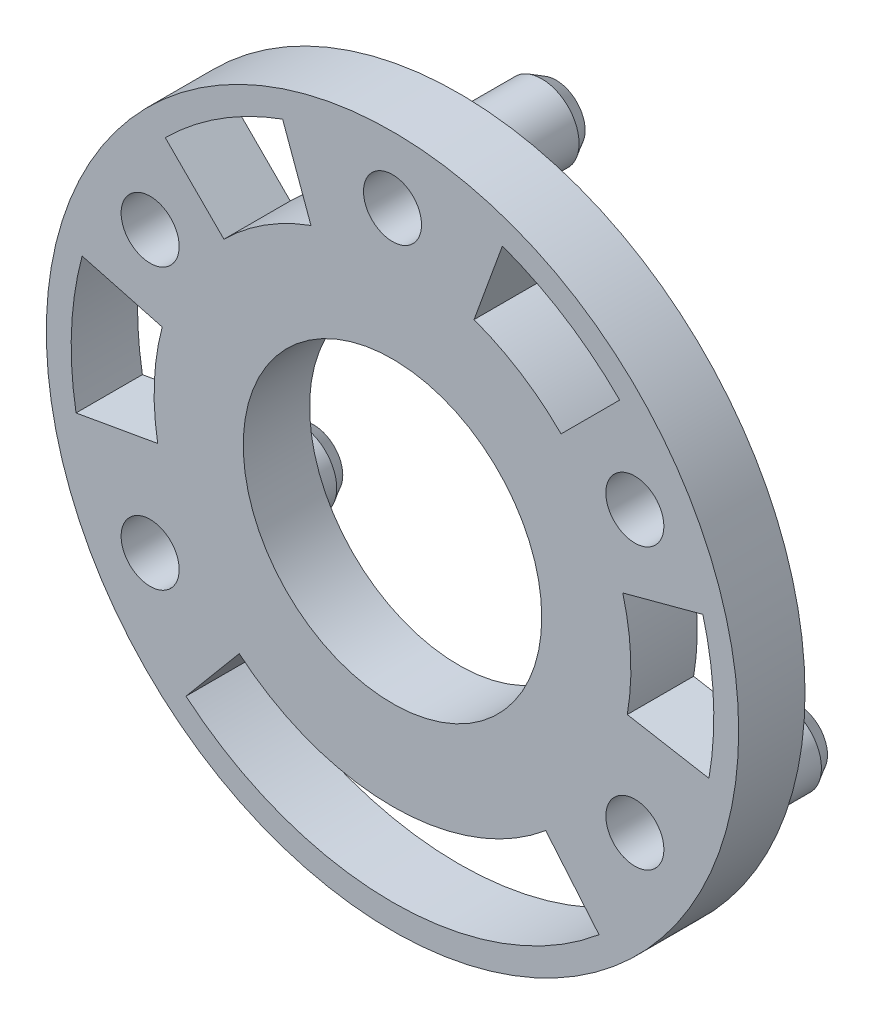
ISO-10303-21;
HEADER;
FILE_DESCRIPTION(('STEP AP214'),'2;1');
FILE_NAME('part.step','',(''),(''),'','','');
FILE_SCHEMA(('AUTOMOTIVE_DESIGN { 1 0 10303 214 1 1 1 1 }'));
ENDSEC;
DATA;
#1=APPLICATION_CONTEXT('core data for automotive mechanical design processes');
#2=APPLICATION_PROTOCOL_DEFINITION('international standard','automotive_design',2000,#1);
#3=PRODUCT_CONTEXT('',#1,'mechanical');
#4=PRODUCT('Part','Part','',(#3));
#5=PRODUCT_RELATED_PRODUCT_CATEGORY('part','',(#4));
#6=PRODUCT_DEFINITION_FORMATION('','',#4);
#7=PRODUCT_DEFINITION_CONTEXT('part definition',#1,'design');
#8=PRODUCT_DEFINITION('design','',#6,#7);
#9=PRODUCT_DEFINITION_SHAPE('','',#8);
#10=(LENGTH_UNIT() NAMED_UNIT(*) SI_UNIT(.MILLI.,.METRE.));
#11=(NAMED_UNIT(*) PLANE_ANGLE_UNIT() SI_UNIT($,.RADIAN.));
#12=(NAMED_UNIT(*) SI_UNIT($,.STERADIAN.) SOLID_ANGLE_UNIT());
#13=UNCERTAINTY_MEASURE_WITH_UNIT(LENGTH_MEASURE(1.E-05),#10,'distance_accuracy_value','');
#14=(GEOMETRIC_REPRESENTATION_CONTEXT(3) GLOBAL_UNCERTAINTY_ASSIGNED_CONTEXT((#13)) GLOBAL_UNIT_ASSIGNED_CONTEXT((#10,
#11,#12)) REPRESENTATION_CONTEXT('',''));
#15=CARTESIAN_POINT('',(0.,0.,0.));
#16=DIRECTION('',(0.,0.,1.));
#17=DIRECTION('',(1.,0.,0.));
#18=AXIS2_PLACEMENT_3D('',#15,#16,#17);
#19=CARTESIAN_POINT('',(0.,0.,4.));
#20=DIRECTION('',(0.,0.,-1.));
#21=DIRECTION('',(-1.,0.,0.));
#22=AXIS2_PLACEMENT_3D('',#19,#20,#21);
#23=CYLINDRICAL_SURFACE('',#22,14.375);
#24=CARTESIAN_POINT('',(0.,0.,0.));
#25=DIRECTION('',(0.,0.,-1.));
#26=DIRECTION('',(-1.,0.,0.));
#27=AXIS2_PLACEMENT_3D('',#24,#25,#26);
#28=CIRCLE('',#27,14.375);
#29=CARTESIAN_POINT('',(13.8851837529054,3.7205237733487,0.));
#30=VERTEX_POINT('',#29);
#31=CARTESIAN_POINT('',(14.1566114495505,-2.49619255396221,0.));
#32=VERTEX_POINT('',#31);
#33=EDGE_CURVE('E485',#30,#32,#28,.T.);
#34=ORIENTED_EDGE('',*,*,#33,.F.);
#35=DIRECTION('',(0.,0.,1.));
#36=VECTOR('',#35,1.);
#37=CARTESIAN_POINT('',(13.8851837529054,3.7205237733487,-13.1414964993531));
#38=LINE('',#37,#36);
#39=CARTESIAN_POINT('',(13.8851837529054,3.7205237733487,4.));
#40=VERTEX_POINT('',#39);
#41=EDGE_CURVE('E58',#30,#40,#38,.T.);
#42=ORIENTED_EDGE('',*,*,#41,.T.);
#43=CARTESIAN_POINT('',(0.,0.,4.));
#44=DIRECTION('',(0.,0.,-1.));
#45=DIRECTION('',(-1.,0.,0.));
#46=AXIS2_PLACEMENT_3D('',#43,#44,#45);
#47=CIRCLE('',#46,14.375);
#48=CARTESIAN_POINT('',(14.1566114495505,-2.49619255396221,4.));
#49=VERTEX_POINT('',#48);
#50=EDGE_CURVE('E205',#40,#49,#47,.T.);
#51=ORIENTED_EDGE('',*,*,#50,.T.);
#52=DIRECTION('',(0.,0.,-1.));
#53=VECTOR('',#52,1.);
#54=CARTESIAN_POINT('',(14.1566114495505,-2.49619255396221,4.));
#55=LINE('',#54,#53);
#56=EDGE_CURVE('E219',#49,#32,#55,.T.);
#57=ORIENTED_EDGE('',*,*,#56,.T.);
#58=EDGE_LOOP('',(#34,#42,#51,#57));
#59=FACE_BOUND('',#58,.T.);
#60=ADVANCED_FACE('F42',(#59),#23,.T.);
#61=CARTESIAN_POINT('',(4.91653956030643,13.5080814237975,4.));
#62=VERTEX_POINT('',#61);
#63=CARTESIAN_POINT('',(10.1646599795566,10.1646599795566,4.));
#64=VERTEX_POINT('',#63);
#65=EDGE_CURVE('E486',#62,#64,#47,.T.);
#66=ORIENTED_EDGE('',*,*,#65,.T.);
#67=DIRECTION('',(0.,0.,1.));
#68=VECTOR('',#67,1.);
#69=CARTESIAN_POINT('',(10.1646599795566,10.1646599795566,-13.1414964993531));
#70=LINE('',#69,#68);
#71=CARTESIAN_POINT('',(10.1646599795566,10.1646599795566,0.));
#72=VERTEX_POINT('',#71);
#73=EDGE_CURVE('E425',#72,#64,#70,.T.);
#74=ORIENTED_EDGE('',*,*,#73,.F.);
#75=CARTESIAN_POINT('',(4.91653956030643,13.5080814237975,0.));
#76=VERTEX_POINT('',#75);
#77=EDGE_CURVE('E492',#76,#72,#28,.T.);
#78=ORIENTED_EDGE('',*,*,#77,.F.);
#79=DIRECTION('',(0.,0.,-1.));
#80=VECTOR('',#79,1.);
#81=CARTESIAN_POINT('',(4.91653956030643,13.5080814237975,4.));
#82=LINE('',#81,#80);
#83=EDGE_CURVE('E210',#62,#76,#82,.T.);
#84=ORIENTED_EDGE('',*,*,#83,.F.);
#85=EDGE_LOOP('',(#66,#74,#78,#84));
#86=FACE_BOUND('',#85,.T.);
#87=ADVANCED_FACE('F316',(#86),#23,.T.);
#88=CARTESIAN_POINT('',(0.,0.,4.));
#89=DIRECTION('',(0.,0.,-1.));
#90=DIRECTION('',(-1.,0.,0.));
#91=AXIS2_PLACEMENT_3D('',#88,#89,#90);
#92=CYLINDRICAL_SURFACE('',#91,19.375);
#93=CARTESIAN_POINT('',(0.,0.,4.));
#94=DIRECTION('',(0.,0.,1.));
#95=DIRECTION('',(-1.,0.,0.));
#96=AXIS2_PLACEMENT_3D('',#93,#94,#95);
#97=CIRCLE('',#96,19.375);
#98=CARTESIAN_POINT('',(19.0806502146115,-3.36443344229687,4.));
#99=VERTEX_POINT('',#98);
#100=CARTESIAN_POINT('',(18.7148128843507,5.01461899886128,4.));
#101=VERTEX_POINT('',#100);
#102=EDGE_CURVE('E194',#99,#101,#97,.T.);
#103=ORIENTED_EDGE('',*,*,#102,.T.);
#104=DIRECTION('',(0.,0.,1.));
#105=VECTOR('',#104,1.);
#106=CARTESIAN_POINT('',(18.7148128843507,5.01461899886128,-13.1414964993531));
#107=LINE('',#106,#105);
#108=CARTESIAN_POINT('',(18.7148128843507,5.01461899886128,0.));
#109=VERTEX_POINT('',#108);
#110=EDGE_CURVE('E180',#109,#101,#107,.T.);
#111=ORIENTED_EDGE('',*,*,#110,.F.);
#112=CARTESIAN_POINT('',(0.,0.,0.));
#113=DIRECTION('',(0.,0.,1.));
#114=DIRECTION('',(-1.,0.,0.));
#115=AXIS2_PLACEMENT_3D('',#112,#113,#114);
#116=CIRCLE('',#115,19.375);
#117=CARTESIAN_POINT('',(19.0806502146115,-3.36443344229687,0.));
#118=VERTEX_POINT('',#117);
#119=EDGE_CURVE('E191',#118,#109,#116,.T.);
#120=ORIENTED_EDGE('',*,*,#119,.F.);
#121=DIRECTION('',(0.,0.,-1.));
#122=VECTOR('',#121,1.);
#123=CARTESIAN_POINT('',(19.0806502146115,-3.36443344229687,4.));
#124=LINE('',#123,#122);
#125=EDGE_CURVE('E217',#99,#118,#124,.T.);
#126=ORIENTED_EDGE('',*,*,#125,.F.);
#127=EDGE_LOOP('',(#103,#111,#120,#126));
#128=FACE_BOUND('',#127,.T.);
#129=ADVANCED_FACE('F189',(#128),#92,.F.);
#130=CARTESIAN_POINT('',(13.7001938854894,13.7001938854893,0.));
#131=VERTEX_POINT('',#130);
#132=CARTESIAN_POINT('',(6.62664027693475,18.206544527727,0.));
#133=VERTEX_POINT('',#132);
#134=EDGE_CURVE('E202',#131,#133,#116,.T.);
#135=ORIENTED_EDGE('',*,*,#134,.F.);
#136=DIRECTION('',(0.,0.,1.));
#137=VECTOR('',#136,1.);
#138=CARTESIAN_POINT('',(13.7001938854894,13.7001938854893,-13.1414964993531));
#139=LINE('',#138,#137);
#140=CARTESIAN_POINT('',(13.7001938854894,13.7001938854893,4.));
#141=VERTEX_POINT('',#140);
#142=EDGE_CURVE('E66',#131,#141,#139,.T.);
#143=ORIENTED_EDGE('',*,*,#142,.T.);
#144=CARTESIAN_POINT('',(6.62664027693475,18.206544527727,4.));
#145=VERTEX_POINT('',#144);
#146=EDGE_CURVE('E490',#141,#145,#97,.T.);
#147=ORIENTED_EDGE('',*,*,#146,.T.);
#148=DIRECTION('',(0.,0.,-1.));
#149=VECTOR('',#148,1.);
#150=CARTESIAN_POINT('',(6.62664027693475,18.206544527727,4.));
#151=LINE('',#150,#149);
#152=EDGE_CURVE('E213',#145,#133,#151,.T.);
#153=ORIENTED_EDGE('',*,*,#152,.T.);
#154=EDGE_LOOP('',(#135,#143,#147,#153));
#155=FACE_BOUND('',#154,.T.);
#156=ADVANCED_FACE('F514',(#155),#92,.F.);
#157=CARTESIAN_POINT('',(0.,0.,4.));
#158=DIRECTION('',(0.,0.,-1.));
#159=DIRECTION('',(-1.,0.,0.));
#160=AXIS2_PLACEMENT_3D('',#157,#158,#159);
#161=CYLINDRICAL_SURFACE('',#160,14.375);
#162=DIRECTION('',(0.,0.,1.));
#163=VECTOR('',#162,1.);
#164=CARTESIAN_POINT('',(-13.8851837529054,3.7205237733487,-13.1414964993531));
#165=LINE('',#164,#163);
#166=CARTESIAN_POINT('',(-13.8851837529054,3.7205237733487,0.));
#167=VERTEX_POINT('',#166);
#168=CARTESIAN_POINT('',(-13.8851837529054,3.7205237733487,4.));
#169=VERTEX_POINT('',#168);
#170=EDGE_CURVE('E449',#167,#169,#165,.T.);
#171=ORIENTED_EDGE('',*,*,#170,.F.);
#172=CARTESIAN_POINT('',(0.,0.,0.));
#173=DIRECTION('',(0.,0.,-1.));
#174=DIRECTION('',(-1.,0.,0.));
#175=AXIS2_PLACEMENT_3D('',#172,#173,#174);
#176=CIRCLE('',#175,14.375);
#177=CARTESIAN_POINT('',(-14.1566114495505,-2.49619255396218,0.));
#178=VERTEX_POINT('',#177);
#179=EDGE_CURVE('E236',#178,#167,#176,.T.);
#180=ORIENTED_EDGE('',*,*,#179,.F.);
#181=DIRECTION('',(0.,0.,-1.));
#182=VECTOR('',#181,1.);
#183=CARTESIAN_POINT('',(-14.1566114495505,-2.49619255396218,4.));
#184=LINE('',#183,#182);
#185=CARTESIAN_POINT('',(-14.1566114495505,-2.49619255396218,4.));
#186=VERTEX_POINT('',#185);
#187=EDGE_CURVE('E235',#186,#178,#184,.T.);
#188=ORIENTED_EDGE('',*,*,#187,.F.);
#189=CARTESIAN_POINT('',(0.,0.,4.));
#190=DIRECTION('',(0.,0.,-1.));
#191=DIRECTION('',(-1.,0.,0.));
#192=AXIS2_PLACEMENT_3D('',#189,#190,#191);
#193=CIRCLE('',#192,14.375);
#194=EDGE_CURVE('E223',#186,#169,#193,.T.);
#195=ORIENTED_EDGE('',*,*,#194,.T.);
#196=EDGE_LOOP('',(#171,#180,#188,#195));
#197=FACE_BOUND('',#196,.T.);
#198=ADVANCED_FACE('F345',(#197),#161,.T.);
#199=CARTESIAN_POINT('',(0.,0.,4.));
#200=DIRECTION('',(0.,0.,-1.));
#201=DIRECTION('',(-1.,0.,0.));
#202=AXIS2_PLACEMENT_3D('',#199,#200,#201);
#203=CYLINDRICAL_SURFACE('',#202,19.375);
#204=DIRECTION('',(0.,0.,1.));
#205=VECTOR('',#204,1.);
#206=CARTESIAN_POINT('',(-18.7148128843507,5.01461899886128,-13.1414964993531));
#207=LINE('',#206,#205);
#208=CARTESIAN_POINT('',(-18.7148128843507,5.01461899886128,0.));
#209=VERTEX_POINT('',#208);
#210=CARTESIAN_POINT('',(-18.7148128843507,5.01461899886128,4.));
#211=VERTEX_POINT('',#210);
#212=EDGE_CURVE('E444',#209,#211,#207,.T.);
#213=ORIENTED_EDGE('',*,*,#212,.T.);
#214=CARTESIAN_POINT('',(0.,0.,4.));
#215=DIRECTION('',(0.,0.,1.));
#216=DIRECTION('',(-1.,0.,0.));
#217=AXIS2_PLACEMENT_3D('',#214,#215,#216);
#218=CIRCLE('',#217,19.375);
#219=CARTESIAN_POINT('',(-19.0806502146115,-3.36443344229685,4.));
#220=VERTEX_POINT('',#219);
#221=EDGE_CURVE('E229',#211,#220,#218,.T.);
#222=ORIENTED_EDGE('',*,*,#221,.T.);
#223=DIRECTION('',(0.,0.,-1.));
#224=VECTOR('',#223,1.);
#225=CARTESIAN_POINT('',(-19.0806502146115,-3.36443344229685,4.));
#226=LINE('',#225,#224);
#227=CARTESIAN_POINT('',(-19.0806502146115,-3.36443344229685,0.));
#228=VERTEX_POINT('',#227);
#229=EDGE_CURVE('E251',#220,#228,#226,.T.);
#230=ORIENTED_EDGE('',*,*,#229,.T.);
#231=CARTESIAN_POINT('',(0.,0.,0.));
#232=DIRECTION('',(0.,0.,1.));
#233=DIRECTION('',(-1.,0.,0.));
#234=AXIS2_PLACEMENT_3D('',#231,#232,#233);
#235=CIRCLE('',#234,19.375);
#236=EDGE_CURVE('E242',#209,#228,#235,.T.);
#237=ORIENTED_EDGE('',*,*,#236,.F.);
#238=EDGE_LOOP('',(#213,#222,#230,#237));
#239=FACE_BOUND('',#238,.T.);
#240=ADVANCED_FACE('F336',(#239),#203,.F.);
#241=CARTESIAN_POINT('',(0.,0.,0.));
#242=DIRECTION('',(0.,0.,1.));
#243=DIRECTION('',(1.,0.,0.));
#244=AXIS2_PLACEMENT_3D('',#241,#242,#243);
#245=PLANE('',#244);
#246=DIRECTION('',(0.965925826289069,0.258819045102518,0.));
#247=VECTOR('',#246,1.);
#248=CARTESIAN_POINT('',(18.7148128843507,5.01461899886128,0.));
#249=LINE('',#248,#247);
#250=EDGE_CURVE('E177',#30,#109,#249,.T.);
#251=ORIENTED_EDGE('',*,*,#250,.F.);
#252=ORIENTED_EDGE('',*,*,#33,.T.);
#253=DIRECTION('',(0.984807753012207,-0.173648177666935,0.));
#254=VECTOR('',#253,1.);
#255=CARTESIAN_POINT('',(19.0806502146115,-3.36443344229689,0.));
#256=LINE('',#255,#254);
#257=EDGE_CURVE('E200',#32,#118,#256,.T.);
#258=ORIENTED_EDGE('',*,*,#257,.T.);
#259=ORIENTED_EDGE('',*,*,#119,.T.);
#260=EDGE_LOOP('',(#251,#252,#258,#259));
#261=FACE_BOUND('',#260,.T.);
#262=ORIENTED_EDGE('',*,*,#179,.T.);
#263=DIRECTION('',(-0.965925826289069,0.258819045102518,0.));
#264=VECTOR('',#263,1.);
#265=CARTESIAN_POINT('',(-18.7148128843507,5.01461899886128,0.));
#266=LINE('',#265,#264);
#267=EDGE_CURVE('E431',#167,#209,#266,.T.);
#268=ORIENTED_EDGE('',*,*,#267,.T.);
#269=ORIENTED_EDGE('',*,*,#236,.T.);
#270=DIRECTION('',(0.984807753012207,0.173648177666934,0.));
#271=VECTOR('',#270,1.);
#272=CARTESIAN_POINT('',(-14.1566114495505,-2.49619255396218,0.));
#273=LINE('',#272,#271);
#274=EDGE_CURVE('E246',#228,#178,#273,.T.);
#275=ORIENTED_EDGE('',*,*,#274,.T.);
#276=EDGE_LOOP('',(#262,#268,#269,#275));
#277=FACE_BOUND('',#276,.T.);
#278=CARTESIAN_POINT('',(14.6141786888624,-8.43750000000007,0.));
#279=DIRECTION('',(0.,0.,1.));
#280=DIRECTION('',(1.,0.,0.));
#281=AXIS2_PLACEMENT_3D('',#278,#279,#280);
#282=CIRCLE('',#281,2.25);
#283=CARTESIAN_POINT('',(16.8641786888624,-8.43750000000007,0.));
#284=VERTEX_POINT('',#283);
#285=EDGE_CURVE('E283',#284,#284,#282,.F.);
#286=ORIENTED_EDGE('',*,*,#285,.F.);
#287=EDGE_LOOP('',(#286));
#288=FACE_BOUND('',#287,.T.);
#289=CARTESIAN_POINT('',(0.,0.,0.));
#290=DIRECTION('',(0.,0.,-1.));
#291=DIRECTION('',(-1.,0.,0.));
#292=AXIS2_PLACEMENT_3D('',#289,#290,#291);
#293=CIRCLE('',#292,14.375);
#294=CARTESIAN_POINT('',(9.24007188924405,-11.0118888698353,0.));
#295=VERTEX_POINT('',#294);
#296=CARTESIAN_POINT('',(-9.24007188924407,-11.0118888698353,0.));
#297=VERTEX_POINT('',#296);
#298=EDGE_CURVE('E455',#295,#297,#293,.T.);
#299=ORIENTED_EDGE('',*,*,#298,.T.);
#300=DIRECTION('',(-0.642787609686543,-0.766044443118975,0.));
#301=VECTOR('',#300,1.);
#302=CARTESIAN_POINT('',(-12.4540099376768,-14.8421110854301,0.));
#303=LINE('',#302,#301);
#304=CARTESIAN_POINT('',(-12.4540099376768,-14.8421110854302,0.));
#305=VERTEX_POINT('',#304);
#306=EDGE_CURVE('E468',#297,#305,#303,.T.);
#307=ORIENTED_EDGE('',*,*,#306,.T.);
#308=CARTESIAN_POINT('',(0.,0.,0.));
#309=DIRECTION('',(0.,0.,1.));
#310=DIRECTION('',(-1.,0.,0.));
#311=AXIS2_PLACEMENT_3D('',#308,#309,#310);
#312=CIRCLE('',#311,19.375);
#313=CARTESIAN_POINT('',(12.4540099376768,-14.8421110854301,0.));
#314=VERTEX_POINT('',#313);
#315=EDGE_CURVE('E471',#305,#314,#312,.T.);
#316=ORIENTED_EDGE('',*,*,#315,.T.);
#317=DIRECTION('',(-0.642787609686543,0.766044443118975,0.));
#318=VECTOR('',#317,1.);
#319=CARTESIAN_POINT('',(9.24007188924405,-11.0118888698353,0.));
#320=LINE('',#319,#318);
#321=EDGE_CURVE('E458',#314,#295,#320,.T.);
#322=ORIENTED_EDGE('',*,*,#321,.T.);
#323=EDGE_LOOP('',(#299,#307,#316,#322));
#324=FACE_BOUND('',#323,.T.);
#325=DIRECTION('',(0.707106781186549,-0.707106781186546,0.));
#326=VECTOR('',#325,1.);
#327=CARTESIAN_POINT('',(-13.7001938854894,13.7001938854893,0.));
#328=LINE('',#327,#326);
#329=CARTESIAN_POINT('',(-13.7001938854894,13.7001938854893,0.));
#330=VERTEX_POINT('',#329);
#331=CARTESIAN_POINT('',(-10.1646599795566,10.1646599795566,0.));
#332=VERTEX_POINT('',#331);
#333=EDGE_CURVE('E435',#330,#332,#328,.T.);
#334=ORIENTED_EDGE('',*,*,#333,.T.);
#335=CARTESIAN_POINT('',(-4.9165395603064,13.5080814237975,0.));
#336=VERTEX_POINT('',#335);
#337=EDGE_CURVE('E222',#332,#336,#176,.T.);
#338=ORIENTED_EDGE('',*,*,#337,.T.);
#339=DIRECTION('',(-0.342020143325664,0.93969262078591,0.));
#340=VECTOR('',#339,1.);
#341=CARTESIAN_POINT('',(-6.62664027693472,18.206544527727,0.));
#342=LINE('',#341,#340);
#343=CARTESIAN_POINT('',(-6.62664027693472,18.206544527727,0.));
#344=VERTEX_POINT('',#343);
#345=EDGE_CURVE('E239',#336,#344,#342,.T.);
#346=ORIENTED_EDGE('',*,*,#345,.T.);
#347=EDGE_CURVE('E243',#344,#330,#235,.T.);
#348=ORIENTED_EDGE('',*,*,#347,.T.);
#349=EDGE_LOOP('',(#334,#338,#346,#348));
#350=FACE_BOUND('',#349,.T.);
#351=CARTESIAN_POINT('',(0.,0.,0.));
#352=DIRECTION('',(0.,0.,1.));
#353=DIRECTION('',(1.,0.,0.));
#354=AXIS2_PLACEMENT_3D('',#351,#352,#353);
#355=CIRCLE('',#354,20.875);
#356=CARTESIAN_POINT('',(20.875,0.,0.));
#357=VERTEX_POINT('',#356);
#358=EDGE_CURVE('E274',#357,#357,#355,.T.);
#359=ORIENTED_EDGE('',*,*,#358,.F.);
#360=EDGE_LOOP('',(#359));
#361=FACE_BOUND('',#360,.T.);
#362=CARTESIAN_POINT('',(0.,0.,0.));
#363=DIRECTION('',(0.,0.,1.));
#364=DIRECTION('',(1.,0.,0.));
#365=AXIS2_PLACEMENT_3D('',#362,#363,#364);
#366=CIRCLE('',#365,9.);
#367=CARTESIAN_POINT('',(9.,0.,0.));
#368=VERTEX_POINT('',#367);
#369=EDGE_CURVE('E259',#368,#368,#366,.T.);
#370=ORIENTED_EDGE('',*,*,#369,.T.);
#371=EDGE_LOOP('',(#370));
#372=FACE_BOUND('',#371,.T.);
#373=ORIENTED_EDGE('',*,*,#77,.T.);
#374=DIRECTION('',(-0.707106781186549,-0.707106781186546,0.));
#375=VECTOR('',#374,1.);
#376=CARTESIAN_POINT('',(13.7001938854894,13.7001938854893,0.));
#377=LINE('',#376,#375);
#378=EDGE_CURVE('E424',#131,#72,#377,.T.);
#379=ORIENTED_EDGE('',*,*,#378,.F.);
#380=ORIENTED_EDGE('',*,*,#134,.T.);
#381=DIRECTION('',(-0.342020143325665,-0.93969262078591,0.));
#382=VECTOR('',#381,1.);
#383=CARTESIAN_POINT('',(4.91653956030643,13.5080814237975,0.));
#384=LINE('',#383,#382);
#385=EDGE_CURVE('E201',#133,#76,#384,.T.);
#386=ORIENTED_EDGE('',*,*,#385,.T.);
#387=EDGE_LOOP('',(#373,#379,#380,#386));
#388=FACE_BOUND('',#387,.T.);
#389=CARTESIAN_POINT('',(0.,16.875,0.));
#390=DIRECTION('',(0.,0.,1.));
#391=DIRECTION('',(1.,0.,0.));
#392=AXIS2_PLACEMENT_3D('',#389,#390,#391);
#393=CIRCLE('',#392,2.25);
#394=CARTESIAN_POINT('',(2.25,16.875,0.));
#395=VERTEX_POINT('',#394);
#396=EDGE_CURVE('E278',#395,#395,#393,.F.);
#397=ORIENTED_EDGE('',*,*,#396,.F.);
#398=EDGE_LOOP('',(#397));
#399=FACE_BOUND('',#398,.T.);
#400=CARTESIAN_POINT('',(-14.6141786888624,-8.43750000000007,0.));
#401=DIRECTION('',(0.,0.,1.));
#402=DIRECTION('',(1.,0.,0.));
#403=AXIS2_PLACEMENT_3D('',#400,#401,#402);
#404=CIRCLE('',#403,2.25);
#405=CARTESIAN_POINT('',(-12.3641786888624,-8.43750000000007,0.));
#406=VERTEX_POINT('',#405);
#407=EDGE_CURVE('E286',#406,#406,#404,.F.);
#408=ORIENTED_EDGE('',*,*,#407,.F.);
#409=EDGE_LOOP('',(#408));
#410=FACE_BOUND('',#409,.T.);
#411=CARTESIAN_POINT('',(-14.6141786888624,8.43749999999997,0.));
#412=DIRECTION('',(0.,0.,1.));
#413=DIRECTION('',(1.,0.,0.));
#414=AXIS2_PLACEMENT_3D('',#411,#412,#413);
#415=CIRCLE('',#414,1.75);
#416=CARTESIAN_POINT('',(-12.8641786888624,8.43749999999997,0.));
#417=VERTEX_POINT('',#416);
#418=EDGE_CURVE('E434',#417,#417,#415,.F.);
#419=ORIENTED_EDGE('',*,*,#418,.F.);
#420=EDGE_LOOP('',(#419));
#421=FACE_BOUND('',#420,.T.);
#422=CARTESIAN_POINT('',(14.6141786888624,8.43749999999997,0.));
#423=DIRECTION('',(0.,0.,1.));
#424=DIRECTION('',(1.,0.,0.));
#425=AXIS2_PLACEMENT_3D('',#422,#423,#424);
#426=CIRCLE('',#425,1.75);
#427=CARTESIAN_POINT('',(16.3641786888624,8.43749999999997,0.));
#428=VERTEX_POINT('',#427);
#429=EDGE_CURVE('E428',#428,#428,#426,.T.);
#430=ORIENTED_EDGE('',*,*,#429,.T.);
#431=EDGE_LOOP('',(#430));
#432=FACE_BOUND('',#431,.T.);
#433=ADVANCED_FACE('F197',(#261,#277,#288,#324,#350,#361,#372,#388,#399,#410,#421,#432),#245,.F.);
#434=CARTESIAN_POINT('',(0.,0.,4.));
#435=DIRECTION('',(0.,0.,1.));
#436=DIRECTION('',(1.,0.,0.));
#437=AXIS2_PLACEMENT_3D('',#434,#435,#436);
#438=PLANE('',#437);
#439=DIRECTION('',(0.707106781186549,0.707106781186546,0.));
#440=VECTOR('',#439,1.);
#441=CARTESIAN_POINT('',(13.7001938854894,13.7001938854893,4.));
#442=LINE('',#441,#440);
#443=EDGE_CURVE('E420',#64,#141,#442,.T.);
#444=ORIENTED_EDGE('',*,*,#443,.F.);
#445=ORIENTED_EDGE('',*,*,#65,.F.);
#446=DIRECTION('',(-0.342020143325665,-0.93969262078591,0.));
#447=VECTOR('',#446,1.);
#448=CARTESIAN_POINT('',(4.91653956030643,13.5080814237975,4.));
#449=LINE('',#448,#447);
#450=EDGE_CURVE('E214',#145,#62,#449,.T.);
#451=ORIENTED_EDGE('',*,*,#450,.F.);
#452=ORIENTED_EDGE('',*,*,#146,.F.);
#453=EDGE_LOOP('',(#444,#445,#451,#452));
#454=FACE_BOUND('',#453,.T.);
#455=CARTESIAN_POINT('',(-10.1646599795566,10.1646599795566,4.));
#456=VERTEX_POINT('',#455);
#457=CARTESIAN_POINT('',(-4.9165395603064,13.5080814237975,4.));
#458=VERTEX_POINT('',#457);
#459=EDGE_CURVE('E227',#456,#458,#193,.T.);
#460=ORIENTED_EDGE('',*,*,#459,.F.);
#461=DIRECTION('',(-0.707106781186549,0.707106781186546,0.));
#462=VECTOR('',#461,1.);
#463=CARTESIAN_POINT('',(-13.7001938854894,13.7001938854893,4.));
#464=LINE('',#463,#462);
#465=CARTESIAN_POINT('',(-13.7001938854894,13.7001938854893,4.));
#466=VERTEX_POINT('',#465);
#467=EDGE_CURVE('E441',#456,#466,#464,.T.);
#468=ORIENTED_EDGE('',*,*,#467,.T.);
#469=CARTESIAN_POINT('',(-6.62664027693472,18.206544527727,4.));
#470=VERTEX_POINT('',#469);
#471=EDGE_CURVE('E230',#470,#466,#218,.T.);
#472=ORIENTED_EDGE('',*,*,#471,.F.);
#473=DIRECTION('',(-0.342020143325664,0.93969262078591,0.));
#474=VECTOR('',#473,1.);
#475=CARTESIAN_POINT('',(-6.62664027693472,18.206544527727,4.));
#476=LINE('',#475,#474);
#477=EDGE_CURVE('E226',#458,#470,#476,.T.);
#478=ORIENTED_EDGE('',*,*,#477,.F.);
#479=EDGE_LOOP('',(#460,#468,#472,#478));
#480=FACE_BOUND('',#479,.T.);
#481=CARTESIAN_POINT('',(14.6141786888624,-8.43750000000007,4.));
#482=DIRECTION('',(0.,0.,1.));
#483=DIRECTION('',(1.,0.,0.));
#484=AXIS2_PLACEMENT_3D('',#481,#482,#483);
#485=CIRCLE('',#484,1.75);
#486=CARTESIAN_POINT('',(16.3641786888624,-8.43750000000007,4.));
#487=VERTEX_POINT('',#486);
#488=EDGE_CURVE('E263',#487,#487,#485,.T.);
#489=ORIENTED_EDGE('',*,*,#488,.F.);
#490=EDGE_LOOP('',(#489));
#491=FACE_BOUND('',#490,.T.);
#492=CARTESIAN_POINT('',(0.,16.875,4.));
#493=DIRECTION('',(0.,0.,1.));
#494=DIRECTION('',(1.,0.,0.));
#495=AXIS2_PLACEMENT_3D('',#492,#493,#494);
#496=CIRCLE('',#495,1.75);
#497=CARTESIAN_POINT('',(1.75,16.875,4.));
#498=VERTEX_POINT('',#497);
#499=EDGE_CURVE('E271',#498,#498,#496,.T.);
#500=ORIENTED_EDGE('',*,*,#499,.F.);
#501=EDGE_LOOP('',(#500));
#502=FACE_BOUND('',#501,.T.);
#503=CARTESIAN_POINT('',(0.,0.,4.));
#504=DIRECTION('',(0.,0.,1.));
#505=DIRECTION('',(1.,0.,0.));
#506=AXIS2_PLACEMENT_3D('',#503,#504,#505);
#507=CIRCLE('',#506,20.875);
#508=CARTESIAN_POINT('',(20.875,0.,4.));
#509=VERTEX_POINT('',#508);
#510=EDGE_CURVE('E275',#509,#509,#507,.T.);
#511=ORIENTED_EDGE('',*,*,#510,.T.);
#512=EDGE_LOOP('',(#511));
#513=FACE_BOUND('',#512,.T.);
#514=CARTESIAN_POINT('',(-14.6141786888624,-8.43750000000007,4.));
#515=DIRECTION('',(0.,0.,1.));
#516=DIRECTION('',(1.,0.,0.));
#517=AXIS2_PLACEMENT_3D('',#514,#515,#516);
#518=CIRCLE('',#517,1.75);
#519=CARTESIAN_POINT('',(-12.8641786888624,-8.43750000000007,4.));
#520=VERTEX_POINT('',#519);
#521=EDGE_CURVE('E268',#520,#520,#518,.T.);
#522=ORIENTED_EDGE('',*,*,#521,.F.);
#523=EDGE_LOOP('',(#522));
#524=FACE_BOUND('',#523,.T.);
#525=CARTESIAN_POINT('',(0.,0.,4.));
#526=DIRECTION('',(0.,0.,1.));
#527=DIRECTION('',(1.,0.,0.));
#528=AXIS2_PLACEMENT_3D('',#525,#526,#527);
#529=CIRCLE('',#528,9.);
#530=CARTESIAN_POINT('',(9.,0.,4.));
#531=VERTEX_POINT('',#530);
#532=EDGE_CURVE('E260',#531,#531,#529,.T.);
#533=ORIENTED_EDGE('',*,*,#532,.F.);
#534=EDGE_LOOP('',(#533));
#535=FACE_BOUND('',#534,.T.);
#536=DIRECTION('',(0.965925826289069,-0.258819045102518,0.));
#537=VECTOR('',#536,1.);
#538=CARTESIAN_POINT('',(-18.7148128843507,5.01461899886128,4.));
#539=LINE('',#538,#537);
#540=EDGE_CURVE('E399',#211,#169,#539,.T.);
#541=ORIENTED_EDGE('',*,*,#540,.T.);
#542=ORIENTED_EDGE('',*,*,#194,.F.);
#543=DIRECTION('',(0.984807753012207,0.173648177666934,0.));
#544=VECTOR('',#543,1.);
#545=CARTESIAN_POINT('',(-14.1566114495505,-2.49619255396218,4.));
#546=LINE('',#545,#544);
#547=EDGE_CURVE('E233',#220,#186,#546,.T.);
#548=ORIENTED_EDGE('',*,*,#547,.F.);
#549=ORIENTED_EDGE('',*,*,#221,.F.);
#550=EDGE_LOOP('',(#541,#542,#548,#549));
#551=FACE_BOUND('',#550,.T.);
#552=DIRECTION('',(0.984807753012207,-0.173648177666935,0.));
#553=VECTOR('',#552,1.);
#554=CARTESIAN_POINT('',(19.0806502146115,-3.36443344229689,4.));
#555=LINE('',#554,#553);
#556=EDGE_CURVE('E403',#49,#99,#555,.T.);
#557=ORIENTED_EDGE('',*,*,#556,.F.);
#558=ORIENTED_EDGE('',*,*,#50,.F.);
#559=DIRECTION('',(-0.965925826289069,-0.258819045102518,0.));
#560=VECTOR('',#559,1.);
#561=CARTESIAN_POINT('',(18.7148128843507,5.01461899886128,4.));
#562=LINE('',#561,#560);
#563=EDGE_CURVE('E195',#101,#40,#562,.T.);
#564=ORIENTED_EDGE('',*,*,#563,.F.);
#565=ORIENTED_EDGE('',*,*,#102,.F.);
#566=EDGE_LOOP('',(#557,#558,#564,#565));
#567=FACE_BOUND('',#566,.T.);
#568=DIRECTION('',(-0.642787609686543,-0.766044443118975,0.));
#569=VECTOR('',#568,1.);
#570=CARTESIAN_POINT('',(-12.4540099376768,-14.8421110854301,4.));
#571=LINE('',#570,#569);
#572=CARTESIAN_POINT('',(-9.24007188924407,-11.0118888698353,4.));
#573=VERTEX_POINT('',#572);
#574=CARTESIAN_POINT('',(-12.4540099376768,-14.8421110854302,4.));
#575=VERTEX_POINT('',#574);
#576=EDGE_CURVE('E408',#573,#575,#571,.T.);
#577=ORIENTED_EDGE('',*,*,#576,.F.);
#578=CARTESIAN_POINT('',(0.,0.,4.));
#579=DIRECTION('',(0.,0.,-1.));
#580=DIRECTION('',(-1.,0.,0.));
#581=AXIS2_PLACEMENT_3D('',#578,#579,#580);
#582=CIRCLE('',#581,14.375);
#583=CARTESIAN_POINT('',(9.24007188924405,-11.0118888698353,4.));
#584=VERTEX_POINT('',#583);
#585=EDGE_CURVE('E456',#584,#573,#582,.T.);
#586=ORIENTED_EDGE('',*,*,#585,.F.);
#587=DIRECTION('',(-0.642787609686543,0.766044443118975,0.));
#588=VECTOR('',#587,1.);
#589=CARTESIAN_POINT('',(9.24007188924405,-11.0118888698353,4.));
#590=LINE('',#589,#588);
#591=CARTESIAN_POINT('',(12.4540099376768,-14.8421110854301,4.));
#592=VERTEX_POINT('',#591);
#593=EDGE_CURVE('E463',#592,#584,#590,.T.);
#594=ORIENTED_EDGE('',*,*,#593,.F.);
#595=CARTESIAN_POINT('',(0.,0.,4.));
#596=DIRECTION('',(0.,0.,1.));
#597=DIRECTION('',(-1.,0.,0.));
#598=AXIS2_PLACEMENT_3D('',#595,#596,#597);
#599=CIRCLE('',#598,19.375);
#600=EDGE_CURVE('E460',#575,#592,#599,.T.);
#601=ORIENTED_EDGE('',*,*,#600,.F.);
#602=EDGE_LOOP('',(#577,#586,#594,#601));
#603=FACE_BOUND('',#602,.T.);
#604=CARTESIAN_POINT('',(-14.6141786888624,8.43749999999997,4.));
#605=DIRECTION('',(0.,0.,1.));
#606=DIRECTION('',(1.,0.,0.));
#607=AXIS2_PLACEMENT_3D('',#604,#605,#606);
#608=CIRCLE('',#607,1.75);
#609=CARTESIAN_POINT('',(-12.8641786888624,8.43749999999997,4.));
#610=VERTEX_POINT('',#609);
#611=EDGE_CURVE('E412',#610,#610,#608,.T.);
#612=ORIENTED_EDGE('',*,*,#611,.F.);
#613=EDGE_LOOP('',(#612));
#614=FACE_BOUND('',#613,.T.);
#615=CARTESIAN_POINT('',(14.6141786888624,8.43749999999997,4.));
#616=DIRECTION('',(0.,0.,-1.));
#617=DIRECTION('',(-1.,0.,0.));
#618=AXIS2_PLACEMENT_3D('',#615,#616,#617);
#619=CIRCLE('',#618,1.75);
#620=CARTESIAN_POINT('',(12.8641786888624,8.43749999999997,4.));
#621=VERTEX_POINT('',#620);
#622=EDGE_CURVE('E415',#621,#621,#619,.T.);
#623=ORIENTED_EDGE('',*,*,#622,.T.);
#624=EDGE_LOOP('',(#623));
#625=FACE_BOUND('',#624,.T.);
#626=ADVANCED_FACE('F360',(#454,#480,#491,#502,#513,#524,#535,#551,#567,#603,#614,#625),#438,.T.);
#627=CARTESIAN_POINT('',(0.,0.,4.));
#628=DIRECTION('',(0.,0.,-1.));
#629=DIRECTION('',(-1.,0.,0.));
#630=AXIS2_PLACEMENT_3D('',#627,#628,#629);
#631=CYLINDRICAL_SURFACE('',#630,20.875);
#632=ORIENTED_EDGE('',*,*,#510,.F.);
#633=EDGE_LOOP('',(#632));
#634=FACE_BOUND('',#633,.T.);
#635=ORIENTED_EDGE('',*,*,#358,.T.);
#636=EDGE_LOOP('',(#635));
#637=FACE_BOUND('',#636,.T.);
#638=ADVANCED_FACE('F359',(#634,#637),#631,.T.);
#639=CARTESIAN_POINT('',(0.,16.875,4.));
#640=DIRECTION('',(0.,0.,-1.));
#641=DIRECTION('',(-1.,0.,0.));
#642=AXIS2_PLACEMENT_3D('',#639,#640,#641);
#643=CYLINDRICAL_SURFACE('',#642,1.75);
#644=CARTESIAN_POINT('',(0.,16.875,-5.86602540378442));
#645=DIRECTION('',(0.,0.,1.));
#646=DIRECTION('',(1.,0.,0.));
#647=AXIS2_PLACEMENT_3D('',#644,#645,#646);
#648=CIRCLE('',#647,1.75);
#649=CARTESIAN_POINT('',(1.75,16.875,-5.86602540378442));
#650=VERTEX_POINT('',#649);
#651=EDGE_CURVE('E51',#650,#650,#648,.F.);
#652=ORIENTED_EDGE('',*,*,#651,.T.);
#653=EDGE_LOOP('',(#652));
#654=FACE_BOUND('',#653,.T.);
#655=ORIENTED_EDGE('',*,*,#499,.T.);
#656=EDGE_LOOP('',(#655));
#657=FACE_BOUND('',#656,.T.);
#658=ADVANCED_FACE('F303',(#654,#657),#643,.F.);
#659=CARTESIAN_POINT('',(-14.6141786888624,-8.43750000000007,4.));
#660=DIRECTION('',(0.,0.,-1.));
#661=DIRECTION('',(-1.,0.,0.));
#662=AXIS2_PLACEMENT_3D('',#659,#660,#661);
#663=CYLINDRICAL_SURFACE('',#662,1.75);
#664=CARTESIAN_POINT('',(-14.6141786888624,-8.43750000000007,-5.86602540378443));
#665=DIRECTION('',(0.,0.,1.));
#666=DIRECTION('',(1.,0.,0.));
#667=AXIS2_PLACEMENT_3D('',#664,#665,#666);
#668=CIRCLE('',#667,1.75);
#669=CARTESIAN_POINT('',(-12.8641786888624,-8.43750000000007,-5.86602540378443));
#670=VERTEX_POINT('',#669);
#671=EDGE_CURVE('E289',#670,#670,#668,.F.);
#672=ORIENTED_EDGE('',*,*,#671,.T.);
#673=EDGE_LOOP('',(#672));
#674=FACE_BOUND('',#673,.T.);
#675=ORIENTED_EDGE('',*,*,#521,.T.);
#676=EDGE_LOOP('',(#675));
#677=FACE_BOUND('',#676,.T.);
#678=ADVANCED_FACE('F352',(#674,#677),#663,.F.);
#679=CARTESIAN_POINT('',(14.6141786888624,-8.43750000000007,4.));
#680=DIRECTION('',(0.,0.,-1.));
#681=DIRECTION('',(-1.,0.,0.));
#682=AXIS2_PLACEMENT_3D('',#679,#680,#681);
#683=CYLINDRICAL_SURFACE('',#682,1.75);
#684=CARTESIAN_POINT('',(14.6141786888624,-8.43750000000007,-5.86602540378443));
#685=DIRECTION('',(0.,0.,1.));
#686=DIRECTION('',(1.,0.,0.));
#687=AXIS2_PLACEMENT_3D('',#684,#685,#686);
#688=CIRCLE('',#687,1.75);
#689=CARTESIAN_POINT('',(16.3641786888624,-8.43750000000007,-5.86602540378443));
#690=VERTEX_POINT('',#689);
#691=EDGE_CURVE('E295',#690,#690,#688,.F.);
#692=ORIENTED_EDGE('',*,*,#691,.T.);
#693=EDGE_LOOP('',(#692));
#694=FACE_BOUND('',#693,.T.);
#695=ORIENTED_EDGE('',*,*,#488,.T.);
#696=EDGE_LOOP('',(#695));
#697=FACE_BOUND('',#696,.T.);
#698=ADVANCED_FACE('F348',(#694,#697),#683,.F.);
#699=CARTESIAN_POINT('',(0.,0.,4.));
#700=DIRECTION('',(0.,0.,-1.));
#701=DIRECTION('',(-1.,0.,0.));
#702=AXIS2_PLACEMENT_3D('',#699,#700,#701);
#703=CYLINDRICAL_SURFACE('',#702,9.);
#704=ORIENTED_EDGE('',*,*,#532,.T.);
#705=EDGE_LOOP('',(#704));
#706=FACE_BOUND('',#705,.T.);
#707=ORIENTED_EDGE('',*,*,#369,.F.);
#708=EDGE_LOOP('',(#707));
#709=FACE_BOUND('',#708,.T.);
#710=ADVANCED_FACE('F343',(#706,#709),#703,.F.);
#711=DIRECTION('',(0.,0.,1.));
#712=VECTOR('',#711,1.);
#713=CARTESIAN_POINT('',(-10.1646599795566,10.1646599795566,-13.1414964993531));
#714=LINE('',#713,#712);
#715=EDGE_CURVE('E446',#332,#456,#714,.T.);
#716=ORIENTED_EDGE('',*,*,#715,.T.);
#717=ORIENTED_EDGE('',*,*,#459,.T.);
#718=DIRECTION('',(0.,0.,-1.));
#719=VECTOR('',#718,1.);
#720=CARTESIAN_POINT('',(-4.9165395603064,13.5080814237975,4.));
#721=LINE('',#720,#719);
#722=EDGE_CURVE('E256',#458,#336,#721,.T.);
#723=ORIENTED_EDGE('',*,*,#722,.T.);
#724=ORIENTED_EDGE('',*,*,#337,.F.);
#725=EDGE_LOOP('',(#716,#717,#723,#724));
#726=FACE_BOUND('',#725,.T.);
#727=ADVANCED_FACE('F339',(#726),#161,.T.);
#728=CARTESIAN_POINT('',(-6.62664027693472,18.206544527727,4.));
#729=DIRECTION('',(-0.93969262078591,-0.342020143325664,0.));
#730=DIRECTION('',(0.342020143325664,-0.93969262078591,0.));
#731=AXIS2_PLACEMENT_3D('',#728,#729,#730);
#732=PLANE('',#731);
#733=ORIENTED_EDGE('',*,*,#345,.F.);
#734=ORIENTED_EDGE('',*,*,#722,.F.);
#735=ORIENTED_EDGE('',*,*,#477,.T.);
#736=DIRECTION('',(0.,0.,-1.));
#737=VECTOR('',#736,1.);
#738=CARTESIAN_POINT('',(-6.62664027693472,18.206544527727,4.));
#739=LINE('',#738,#737);
#740=EDGE_CURVE('E254',#470,#344,#739,.T.);
#741=ORIENTED_EDGE('',*,*,#740,.T.);
#742=EDGE_LOOP('',(#733,#734,#735,#741));
#743=FACE_BOUND('',#742,.T.);
#744=ADVANCED_FACE('F334',(#743),#732,.T.);
#745=DIRECTION('',(0.,0.,1.));
#746=VECTOR('',#745,1.);
#747=CARTESIAN_POINT('',(-13.7001938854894,13.7001938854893,-13.1414964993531));
#748=LINE('',#747,#746);
#749=EDGE_CURVE('E438',#330,#466,#748,.T.);
#750=ORIENTED_EDGE('',*,*,#749,.F.);
#751=ORIENTED_EDGE('',*,*,#347,.F.);
#752=ORIENTED_EDGE('',*,*,#740,.F.);
#753=ORIENTED_EDGE('',*,*,#471,.T.);
#754=EDGE_LOOP('',(#750,#751,#752,#753));
#755=FACE_BOUND('',#754,.T.);
#756=ADVANCED_FACE('F330',(#755),#203,.F.);
#757=CARTESIAN_POINT('',(-14.1566114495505,-2.49619255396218,4.));
#758=DIRECTION('',(-0.173648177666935,0.984807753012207,0.));
#759=DIRECTION('',(-0.984807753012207,-0.173648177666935,0.));
#760=AXIS2_PLACEMENT_3D('',#757,#758,#759);
#761=PLANE('',#760);
#762=ORIENTED_EDGE('',*,*,#274,.F.);
#763=ORIENTED_EDGE('',*,*,#229,.F.);
#764=ORIENTED_EDGE('',*,*,#547,.T.);
#765=ORIENTED_EDGE('',*,*,#187,.T.);
#766=EDGE_LOOP('',(#762,#763,#764,#765));
#767=FACE_BOUND('',#766,.T.);
#768=ADVANCED_FACE('F327',(#767),#761,.T.);
#769=CARTESIAN_POINT('',(19.0806502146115,-3.36443344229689,4.));
#770=DIRECTION('',(0.173648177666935,0.984807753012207,0.));
#771=DIRECTION('',(-0.984807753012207,0.173648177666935,0.));
#772=AXIS2_PLACEMENT_3D('',#769,#770,#771);
#773=PLANE('',#772);
#774=ORIENTED_EDGE('',*,*,#257,.F.);
#775=ORIENTED_EDGE('',*,*,#56,.F.);
#776=ORIENTED_EDGE('',*,*,#556,.T.);
#777=ORIENTED_EDGE('',*,*,#125,.T.);
#778=EDGE_LOOP('',(#774,#775,#776,#777));
#779=FACE_BOUND('',#778,.T.);
#780=ADVANCED_FACE('F325',(#779),#773,.T.);
#781=CARTESIAN_POINT('',(4.91653956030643,13.5080814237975,4.));
#782=DIRECTION('',(0.93969262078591,-0.342020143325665,0.));
#783=DIRECTION('',(0.342020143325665,0.93969262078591,0.));
#784=AXIS2_PLACEMENT_3D('',#781,#782,#783);
#785=PLANE('',#784);
#786=ORIENTED_EDGE('',*,*,#385,.F.);
#787=ORIENTED_EDGE('',*,*,#152,.F.);
#788=ORIENTED_EDGE('',*,*,#450,.T.);
#789=ORIENTED_EDGE('',*,*,#83,.T.);
#790=EDGE_LOOP('',(#786,#787,#788,#789));
#791=FACE_BOUND('',#790,.T.);
#792=ADVANCED_FACE('F498',(#791),#785,.T.);
#793=CARTESIAN_POINT('',(0.,0.,4.));
#794=DIRECTION('',(0.,0.,-1.));
#795=DIRECTION('',(-1.,0.,0.));
#796=AXIS2_PLACEMENT_3D('',#793,#794,#795);
#797=CYLINDRICAL_SURFACE('',#796,14.375);
#798=ORIENTED_EDGE('',*,*,#298,.F.);
#799=DIRECTION('',(0.,0.,-1.));
#800=VECTOR('',#799,1.);
#801=CARTESIAN_POINT('',(9.24007188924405,-11.0118888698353,4.));
#802=LINE('',#801,#800);
#803=EDGE_CURVE('E465',#584,#295,#802,.T.);
#804=ORIENTED_EDGE('',*,*,#803,.F.);
#805=ORIENTED_EDGE('',*,*,#585,.T.);
#806=DIRECTION('',(0.,0.,-1.));
#807=VECTOR('',#806,1.);
#808=CARTESIAN_POINT('',(-9.24007188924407,-11.0118888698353,4.));
#809=LINE('',#808,#807);
#810=EDGE_CURVE('E482',#573,#297,#809,.T.);
#811=ORIENTED_EDGE('',*,*,#810,.T.);
#812=EDGE_LOOP('',(#798,#804,#805,#811));
#813=FACE_BOUND('',#812,.T.);
#814=ADVANCED_FACE('F502',(#813),#797,.T.);
#815=CARTESIAN_POINT('',(-12.4540099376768,-14.8421110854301,4.));
#816=DIRECTION('',(0.766044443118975,-0.642787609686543,0.));
#817=DIRECTION('',(0.642787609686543,0.766044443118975,0.));
#818=AXIS2_PLACEMENT_3D('',#815,#816,#817);
#819=PLANE('',#818);
#820=ORIENTED_EDGE('',*,*,#306,.F.);
#821=ORIENTED_EDGE('',*,*,#810,.F.);
#822=ORIENTED_EDGE('',*,*,#576,.T.);
#823=DIRECTION('',(0.,0.,-1.));
#824=VECTOR('',#823,1.);
#825=CARTESIAN_POINT('',(-12.4540099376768,-14.8421110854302,4.));
#826=LINE('',#825,#824);
#827=EDGE_CURVE('E480',#575,#305,#826,.T.);
#828=ORIENTED_EDGE('',*,*,#827,.T.);
#829=EDGE_LOOP('',(#820,#821,#822,#828));
#830=FACE_BOUND('',#829,.T.);
#831=ADVANCED_FACE('F508',(#830),#819,.T.);
#832=CARTESIAN_POINT('',(0.,0.,4.));
#833=DIRECTION('',(0.,0.,-1.));
#834=DIRECTION('',(-1.,0.,0.));
#835=AXIS2_PLACEMENT_3D('',#832,#833,#834);
#836=CYLINDRICAL_SURFACE('',#835,19.375);
#837=ORIENTED_EDGE('',*,*,#315,.F.);
#838=ORIENTED_EDGE('',*,*,#827,.F.);
#839=ORIENTED_EDGE('',*,*,#600,.T.);
#840=DIRECTION('',(0.,0.,-1.));
#841=VECTOR('',#840,1.);
#842=CARTESIAN_POINT('',(12.4540099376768,-14.8421110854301,4.));
#843=LINE('',#842,#841);
#844=EDGE_CURVE('E478',#592,#314,#843,.T.);
#845=ORIENTED_EDGE('',*,*,#844,.T.);
#846=EDGE_LOOP('',(#837,#838,#839,#845));
#847=FACE_BOUND('',#846,.T.);
#848=ADVANCED_FACE('F586',(#847),#836,.F.);
#849=CARTESIAN_POINT('',(9.24007188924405,-11.0118888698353,4.));
#850=DIRECTION('',(-0.766044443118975,-0.642787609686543,0.));
#851=DIRECTION('',(0.642787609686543,-0.766044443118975,0.));
#852=AXIS2_PLACEMENT_3D('',#849,#850,#851);
#853=PLANE('',#852);
#854=ORIENTED_EDGE('',*,*,#321,.F.);
#855=ORIENTED_EDGE('',*,*,#844,.F.);
#856=ORIENTED_EDGE('',*,*,#593,.T.);
#857=ORIENTED_EDGE('',*,*,#803,.T.);
#858=EDGE_LOOP('',(#854,#855,#856,#857));
#859=FACE_BOUND('',#858,.T.);
#860=ADVANCED_FACE('F582',(#859),#853,.T.);
#861=CARTESIAN_POINT('',(0.,16.875,-6.));
#862=DIRECTION('',(0.,0.,1.));
#863=DIRECTION('',(1.,0.,0.));
#864=AXIS2_PLACEMENT_3D('',#861,#862,#863);
#865=CYLINDRICAL_SURFACE('',#864,2.25);
#866=CARTESIAN_POINT('',(0.,16.875,-5.));
#867=DIRECTION('',(0.,0.,-1.));
#868=DIRECTION('',(-1.,0.,0.));
#869=AXIS2_PLACEMENT_3D('',#866,#867,#868);
#870=CIRCLE('',#869,2.25);
#871=CARTESIAN_POINT('',(-2.25,16.875,-5.));
#872=VERTEX_POINT('',#871);
#873=EDGE_CURVE('E11',#872,#872,#870,.F.);
#874=ORIENTED_EDGE('',*,*,#873,.T.);
#875=EDGE_LOOP('',(#874));
#876=FACE_BOUND('',#875,.T.);
#877=ORIENTED_EDGE('',*,*,#396,.T.);
#878=EDGE_LOOP('',(#877));
#879=FACE_BOUND('',#878,.T.);
#880=ADVANCED_FACE('F578',(#876,#879),#865,.T.);
#881=CARTESIAN_POINT('',(14.6141786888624,-8.43750000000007,-6.));
#882=DIRECTION('',(0.,0.,1.));
#883=DIRECTION('',(1.,0.,0.));
#884=AXIS2_PLACEMENT_3D('',#881,#882,#883);
#885=CYLINDRICAL_SURFACE('',#884,2.25);
#886=CARTESIAN_POINT('',(14.6141786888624,-8.43750000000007,-5.));
#887=DIRECTION('',(0.,0.,-1.));
#888=DIRECTION('',(-1.,0.,0.));
#889=AXIS2_PLACEMENT_3D('',#886,#887,#888);
#890=CIRCLE('',#889,2.25);
#891=CARTESIAN_POINT('',(12.3641786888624,-8.43750000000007,-5.));
#892=VERTEX_POINT('',#891);
#893=EDGE_CURVE('E298',#892,#892,#890,.F.);
#894=ORIENTED_EDGE('',*,*,#893,.T.);
#895=EDGE_LOOP('',(#894));
#896=FACE_BOUND('',#895,.T.);
#897=ORIENTED_EDGE('',*,*,#285,.T.);
#898=EDGE_LOOP('',(#897));
#899=FACE_BOUND('',#898,.T.);
#900=ADVANCED_FACE('F574',(#896,#899),#885,.T.);
#901=CARTESIAN_POINT('',(-14.6141786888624,-8.43750000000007,-6.));
#902=DIRECTION('',(0.,0.,1.));
#903=DIRECTION('',(1.,0.,0.));
#904=AXIS2_PLACEMENT_3D('',#901,#902,#903);
#905=CYLINDRICAL_SURFACE('',#904,2.25);
#906=CARTESIAN_POINT('',(-14.6141786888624,-8.43750000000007,-5.));
#907=DIRECTION('',(0.,0.,-1.));
#908=DIRECTION('',(-1.,0.,0.));
#909=AXIS2_PLACEMENT_3D('',#906,#907,#908);
#910=CIRCLE('',#909,2.25);
#911=CARTESIAN_POINT('',(-16.8641786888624,-8.43750000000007,-5.));
#912=VERTEX_POINT('',#911);
#913=EDGE_CURVE('E292',#912,#912,#910,.F.);
#914=ORIENTED_EDGE('',*,*,#913,.T.);
#915=EDGE_LOOP('',(#914));
#916=FACE_BOUND('',#915,.T.);
#917=ORIENTED_EDGE('',*,*,#407,.T.);
#918=EDGE_LOOP('',(#917));
#919=FACE_BOUND('',#918,.T.);
#920=ADVANCED_FACE('F568',(#916,#919),#905,.T.);
#921=CARTESIAN_POINT('',(-18.7148128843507,5.01461899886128,-13.1414964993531));
#922=DIRECTION('',(-0.258819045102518,-0.965925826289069,0.));
#923=DIRECTION('',(0.965925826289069,-0.258819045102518,0.));
#924=AXIS2_PLACEMENT_3D('',#921,#922,#923);
#925=PLANE('',#924);
#926=ORIENTED_EDGE('',*,*,#267,.F.);
#927=ORIENTED_EDGE('',*,*,#170,.T.);
#928=ORIENTED_EDGE('',*,*,#540,.F.);
#929=ORIENTED_EDGE('',*,*,#212,.F.);
#930=EDGE_LOOP('',(#926,#927,#928,#929));
#931=FACE_BOUND('',#930,.T.);
#932=ADVANCED_FACE('F560',(#931),#925,.T.);
#933=CARTESIAN_POINT('',(-13.7001938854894,13.7001938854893,-13.1414964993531));
#934=DIRECTION('',(0.707106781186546,0.707106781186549,0.));
#935=DIRECTION('',(-0.707106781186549,0.707106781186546,0.));
#936=AXIS2_PLACEMENT_3D('',#933,#934,#935);
#937=PLANE('',#936);
#938=ORIENTED_EDGE('',*,*,#333,.F.);
#939=ORIENTED_EDGE('',*,*,#749,.T.);
#940=ORIENTED_EDGE('',*,*,#467,.F.);
#941=ORIENTED_EDGE('',*,*,#715,.F.);
#942=EDGE_LOOP('',(#938,#939,#940,#941));
#943=FACE_BOUND('',#942,.T.);
#944=ADVANCED_FACE('F557',(#943),#937,.T.);
#945=CARTESIAN_POINT('',(-14.6141786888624,8.43749999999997,-13.1414964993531));
#946=DIRECTION('',(0.,0.,1.));
#947=DIRECTION('',(1.,0.,0.));
#948=AXIS2_PLACEMENT_3D('',#945,#946,#947);
#949=CYLINDRICAL_SURFACE('',#948,1.75);
#950=ORIENTED_EDGE('',*,*,#418,.T.);
#951=EDGE_LOOP('',(#950));
#952=FACE_BOUND('',#951,.T.);
#953=ORIENTED_EDGE('',*,*,#611,.T.);
#954=EDGE_LOOP('',(#953));
#955=FACE_BOUND('',#954,.T.);
#956=ADVANCED_FACE('F559',(#952,#955),#949,.F.);
#957=CARTESIAN_POINT('',(18.7148128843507,5.01461899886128,-13.1414964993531));
#958=DIRECTION('',(-0.258819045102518,0.965925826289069,0.));
#959=DIRECTION('',(-0.965925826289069,-0.258819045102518,0.));
#960=AXIS2_PLACEMENT_3D('',#957,#958,#959);
#961=PLANE('',#960);
#962=ORIENTED_EDGE('',*,*,#41,.F.);
#963=ORIENTED_EDGE('',*,*,#250,.T.);
#964=ORIENTED_EDGE('',*,*,#110,.T.);
#965=ORIENTED_EDGE('',*,*,#563,.T.);
#966=EDGE_LOOP('',(#962,#963,#964,#965));
#967=FACE_BOUND('',#966,.T.);
#968=ADVANCED_FACE('F179',(#967),#961,.F.);
#969=CARTESIAN_POINT('',(13.7001938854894,13.7001938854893,-13.1414964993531));
#970=DIRECTION('',(0.707106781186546,-0.707106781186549,0.));
#971=DIRECTION('',(0.707106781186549,0.707106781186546,0.));
#972=AXIS2_PLACEMENT_3D('',#969,#970,#971);
#973=PLANE('',#972);
#974=ORIENTED_EDGE('',*,*,#142,.F.);
#975=ORIENTED_EDGE('',*,*,#378,.T.);
#976=ORIENTED_EDGE('',*,*,#73,.T.);
#977=ORIENTED_EDGE('',*,*,#443,.T.);
#978=EDGE_LOOP('',(#974,#975,#976,#977));
#979=FACE_BOUND('',#978,.T.);
#980=ADVANCED_FACE('F383',(#979),#973,.F.);
#981=CARTESIAN_POINT('',(14.6141786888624,8.43749999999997,-13.1414964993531));
#982=DIRECTION('',(0.,0.,1.));
#983=DIRECTION('',(1.,0.,0.));
#984=AXIS2_PLACEMENT_3D('',#981,#982,#983);
#985=CYLINDRICAL_SURFACE('',#984,1.75);
#986=ORIENTED_EDGE('',*,*,#429,.F.);
#987=EDGE_LOOP('',(#986));
#988=FACE_BOUND('',#987,.T.);
#989=ORIENTED_EDGE('',*,*,#622,.F.);
#990=EDGE_LOOP('',(#989));
#991=FACE_BOUND('',#990,.T.);
#992=ADVANCED_FACE('F374',(#988,#991),#985,.F.);
#993=CARTESIAN_POINT('',(-14.6141786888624,-8.43750000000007,-6.));
#994=DIRECTION('',(0.,0.,1.));
#995=DIRECTION('',(1.,0.,0.));
#996=AXIS2_PLACEMENT_3D('',#993,#994,#995);
#997=CONICAL_SURFACE('',#996,1.67264973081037,0.523598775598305);
#998=ORIENTED_EDGE('',*,*,#913,.F.);
#999=EDGE_LOOP('',(#998));
#1000=FACE_BOUND('',#999,.T.);
#1001=ORIENTED_EDGE('',*,*,#671,.F.);
#1002=EDGE_LOOP('',(#1001));
#1003=FACE_BOUND('',#1002,.T.);
#1004=ADVANCED_FACE('F312',(#1000,#1003),#997,.T.);
#1005=CARTESIAN_POINT('',(14.6141786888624,-8.43750000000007,-6.));
#1006=DIRECTION('',(0.,0.,1.));
#1007=DIRECTION('',(1.,0.,0.));
#1008=AXIS2_PLACEMENT_3D('',#1005,#1006,#1007);
#1009=CONICAL_SURFACE('',#1008,1.67264973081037,0.523598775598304);
#1010=ORIENTED_EDGE('',*,*,#893,.F.);
#1011=EDGE_LOOP('',(#1010));
#1012=FACE_BOUND('',#1011,.T.);
#1013=ORIENTED_EDGE('',*,*,#691,.F.);
#1014=EDGE_LOOP('',(#1013));
#1015=FACE_BOUND('',#1014,.T.);
#1016=ADVANCED_FACE('F307',(#1012,#1015),#1009,.T.);
#1017=CARTESIAN_POINT('',(0.,16.875,-6.));
#1018=DIRECTION('',(0.,0.,1.));
#1019=DIRECTION('',(1.,0.,0.));
#1020=AXIS2_PLACEMENT_3D('',#1017,#1018,#1019);
#1021=CONICAL_SURFACE('',#1020,1.67264973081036,0.523598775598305);
#1022=ORIENTED_EDGE('',*,*,#873,.F.);
#1023=EDGE_LOOP('',(#1022));
#1024=FACE_BOUND('',#1023,.T.);
#1025=ORIENTED_EDGE('',*,*,#651,.F.);
#1026=EDGE_LOOP('',(#1025));
#1027=FACE_BOUND('',#1026,.T.);
#1028=ADVANCED_FACE('F45',(#1024,#1027),#1021,.T.);
#1029=CLOSED_SHELL('',(#60,#87,#129,#156,#198,#240,#433,#626,#638,#658,#678,#698,#710,#727,#744,
#756,#768,#780,#792,#814,#831,#848,#860,#880,#900,#920,#932,#944,#956,#968,#980,#992,#1004,
#1016,#1028));
#1030=MANIFOLD_SOLID_BREP('B2',#1029);
#1031=ADVANCED_BREP_SHAPE_REPRESENTATION('',(#18,#1030),#14);
#1032=SHAPE_DEFINITION_REPRESENTATION(#9,#1031);
ENDSEC;
END-ISO-10303-21;
